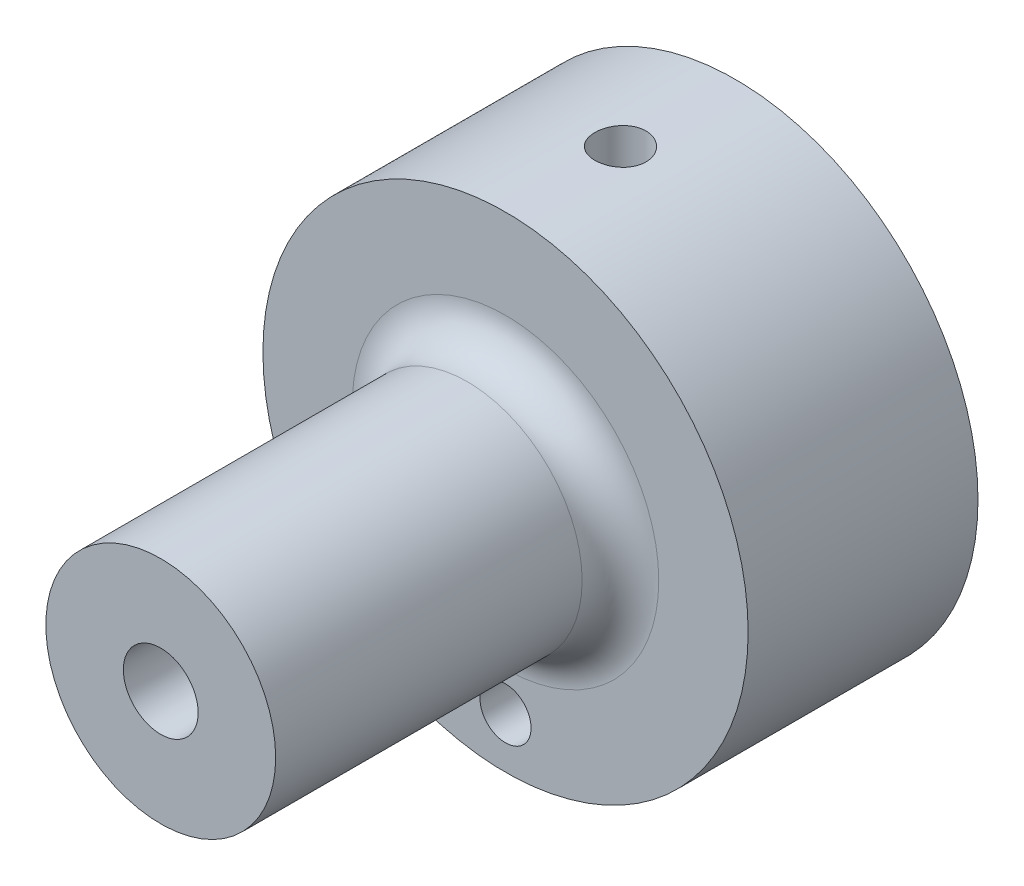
from build123d import *


with BuildPart() as part:
    # Sketch1 → Revolve1 (revolve)
    with BuildSketch(Plane(origin=(0, 0, 0), x_dir=(0, 0, -1), z_dir=(1, 0, 0)), mode=Mode.PRIVATE) as revolve1_sk:
        with BuildLine():
            Line((-27, 2.928366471), (18, 1.75))
            Line((18, 1.75), (18, 19))
            Line((18, 19), (0, 19))
            Line((0, 19), (0, 12))
            ThreePointArc((0, 12), (-0.878679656, 9.878679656), (-3, 9))
            Line((-3, 9), (-27, 9))
            Line((-27, 9), (-27, 2.928366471))
        make_face()
    revolve(revolve1_sk.sketch.rotate(Axis((0, 0, 27), (0, 0, -1)), 90), axis=Axis((0, 0, 27), (0, 0, -1)))

    # Sketch2 → Cut-Revolve1 (revolve, cut)
    with BuildSketch(Plane(origin=(0, 0, 0), x_dir=(0, 0, -1), z_dir=(1, 0, 0)), mode=Mode.PRIVATE) as cut_revolve1_sk:
        Polygon((11, 19), (9, 19), (9, 11.798278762), (11, 13), align=None)
    revolve(cut_revolve1_sk.sketch.rotate(Axis((0, 19, -9), (0, -1, 0)), 180), axis=Axis((0, 19, -9), (0, -1, 0)), mode=Mode.SUBTRACT)

    # Sketch3 → Cut-Revolve2 (revolve, cut)
    with BuildSketch(Plane(origin=(0, -24, -19), x_dir=(0, 1, 0), z_dir=(1, 0, 0)), mode=Mode.PRIVATE) as cut_revolve2_sk:
        Polygon((11, 19), (9, 19), (9, 11.798278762), (11, 13), align=None)
    revolve(cut_revolve2_sk.sketch.rotate(Axis((0, -15, 0), (0, 0, -1)), 180), axis=Axis((0, -15, 0), (0, 0, -1)), mode=Mode.SUBTRACT)

    # Sketch4 → Cut-Revolve3 (revolve, cut)
    with BuildSketch(Plane(origin=(0, 0, 0), x_dir=(0, 0, -1), z_dir=(1, 0, 0)), mode=Mode.PRIVATE) as cut_revolve3_sk:
        with BuildLine():
            Line((18, 0), (18, 6.652067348))
            ThreePointArc((18, 6.652067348), (16.879649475, 3.409545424), (16.5, 0))
            Line((16.5, 0), (18, 0))
        make_face()
    revolve(cut_revolve3_sk.sketch.rotate(Axis((0, 0, -16.5), (0, 0, -1)), 90), axis=Axis((0, 0, -16.5), (0, 0, -1)), mode=Mode.SUBTRACT)


solid = part.part
